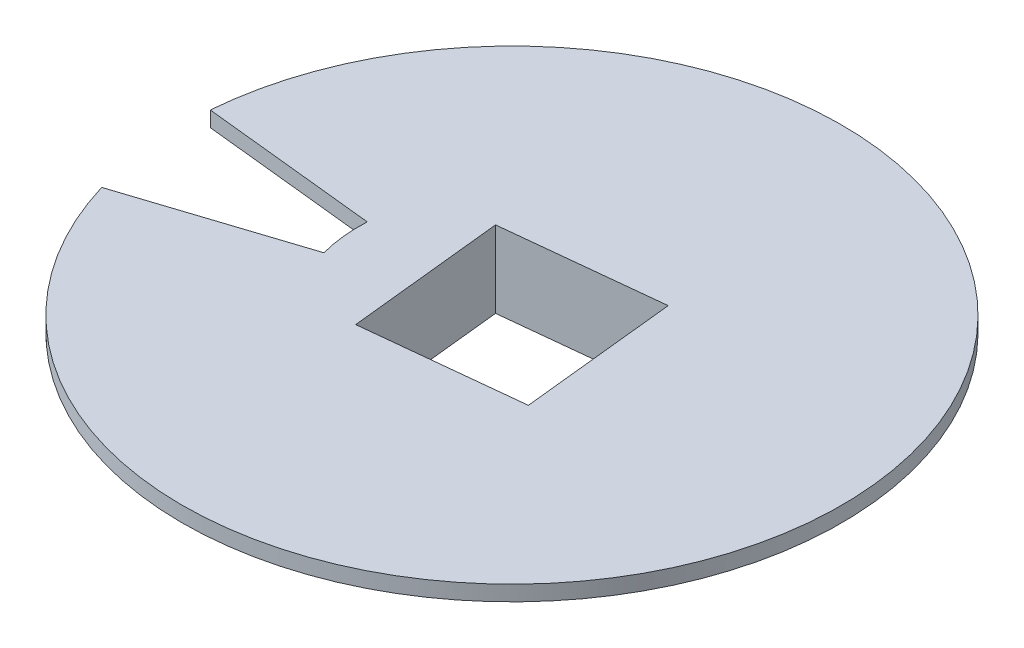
ISO-10303-21;
HEADER;
FILE_DESCRIPTION(('STEP AP214'),'2;1');
FILE_NAME('part.step','',(''),(''),'','','');
FILE_SCHEMA(('AUTOMOTIVE_DESIGN { 1 0 10303 214 1 1 1 1 }'));
ENDSEC;
DATA;
#1=APPLICATION_CONTEXT('core data for automotive mechanical design processes');
#2=APPLICATION_PROTOCOL_DEFINITION('international standard','automotive_design',2000,#1);
#3=PRODUCT_CONTEXT('',#1,'mechanical');
#4=PRODUCT('Part','Part','',(#3));
#5=PRODUCT_RELATED_PRODUCT_CATEGORY('part','',(#4));
#6=PRODUCT_DEFINITION_FORMATION('','',#4);
#7=PRODUCT_DEFINITION_CONTEXT('part definition',#1,'design');
#8=PRODUCT_DEFINITION('design','',#6,#7);
#9=PRODUCT_DEFINITION_SHAPE('','',#8);
#10=(LENGTH_UNIT() NAMED_UNIT(*) SI_UNIT(.MILLI.,.METRE.));
#11=(NAMED_UNIT(*) PLANE_ANGLE_UNIT() SI_UNIT($,.RADIAN.));
#12=(NAMED_UNIT(*) SI_UNIT($,.STERADIAN.) SOLID_ANGLE_UNIT());
#13=UNCERTAINTY_MEASURE_WITH_UNIT(LENGTH_MEASURE(1.E-05),#10,'distance_accuracy_value','');
#14=(GEOMETRIC_REPRESENTATION_CONTEXT(3) GLOBAL_UNCERTAINTY_ASSIGNED_CONTEXT((#13)) GLOBAL_UNIT_ASSIGNED_CONTEXT((#10,
#11,#12)) REPRESENTATION_CONTEXT('',''));
#15=CARTESIAN_POINT('',(0.,0.,0.));
#16=DIRECTION('',(0.,0.,1.));
#17=DIRECTION('',(1.,0.,0.));
#18=AXIS2_PLACEMENT_3D('',#15,#16,#17);
#19=CARTESIAN_POINT('',(0.,-4.,0.));
#20=DIRECTION('',(0.,-1.,0.));
#21=DIRECTION('',(1.,0.,0.));
#22=AXIS2_PLACEMENT_3D('',#19,#20,#21);
#23=PLANE('',#22);
#24=DIRECTION('',(-0.994521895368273,0.,-0.104528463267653));
#25=VECTOR('',#24,1.);
#26=CARTESIAN_POINT('',(-0.209056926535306,-4.00000000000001,1.98904379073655));
#27=LINE('',#26,#25);
#28=CARTESIAN_POINT('',(-39.9401755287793,-4.00000000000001,-2.18686504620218));
#29=VERTEX_POINT('',#28);
#30=CARTESIAN_POINT('',(-85.7148083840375,-4.00000000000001,-6.99797282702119));
#31=VERTEX_POINT('',#30);
#32=EDGE_CURVE('E141',#29,#31,#27,.T.);
#33=ORIENTED_EDGE('',*,*,#32,.T.);
#34=CARTESIAN_POINT('',(0.,-4.,0.));
#35=DIRECTION('',(0.,1.,0.));
#36=DIRECTION('',(-1.,0.,0.));
#37=AXIS2_PLACEMENT_3D('',#34,#35,#36);
#38=CIRCLE('',#37,86.);
#39=CARTESIAN_POINT('',(-82.3867738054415,-4.00000000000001,24.6661610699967));
#40=VERTEX_POINT('',#39);
#41=EDGE_CURVE('E160',#40,#31,#38,.T.);
#42=ORIENTED_EDGE('',*,*,#41,.F.);
#43=DIRECTION('',(-0.951056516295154,0.,0.309016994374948));
#44=VECTOR('',#43,1.);
#45=CARTESIAN_POINT('',(-0.618033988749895,-4.00000000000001,-1.90211303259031));
#46=LINE('',#45,#44);
#47=CARTESIAN_POINT('',(-38.6127120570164,-4.00000000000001,10.4431062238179));
#48=VERTEX_POINT('',#47);
#49=EDGE_CURVE('E144',#48,#40,#46,.T.);
#50=ORIENTED_EDGE('',*,*,#49,.F.);
#51=CARTESIAN_POINT('',(0.,-4.00000000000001,0.));
#52=DIRECTION('',(0.,1.,0.));
#53=DIRECTION('',(0.,0.,1.));
#54=AXIS2_PLACEMENT_3D('',#51,#52,#53);
#55=CIRCLE('',#54,40.);
#56=EDGE_CURVE('E155',#48,#29,#55,.T.);
#57=ORIENTED_EDGE('',*,*,#56,.T.);
#58=EDGE_LOOP('',(#33,#42,#50,#57));
#59=FACE_BOUND('',#58,.T.);
#60=ADVANCED_FACE('F34',(#59),#23,.T.);
#61=CARTESIAN_POINT('',(0.,0.,0.));
#62=DIRECTION('',(0.,1.,0.));
#63=DIRECTION('',(-1.,0.,0.));
#64=AXIS2_PLACEMENT_3D('',#61,#62,#63);
#65=CYLINDRICAL_SURFACE('',#64,86.);
#66=DIRECTION('',(0.,1.,0.));
#67=VECTOR('',#66,1.);
#68=CARTESIAN_POINT('',(-85.7148083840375,0.,-6.99797282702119));
#69=LINE('',#68,#67);
#70=CARTESIAN_POINT('',(-85.7148083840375,0.,-6.99797282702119));
#71=VERTEX_POINT('',#70);
#72=EDGE_CURVE('E153',#71,#31,#69,.F.);
#73=ORIENTED_EDGE('',*,*,#72,.F.);
#74=CARTESIAN_POINT('',(0.,0.,0.));
#75=DIRECTION('',(0.,1.,0.));
#76=DIRECTION('',(-1.,0.,0.));
#77=AXIS2_PLACEMENT_3D('',#74,#75,#76);
#78=CIRCLE('',#77,86.);
#79=CARTESIAN_POINT('',(-82.3867738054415,0.,24.6661610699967));
#80=VERTEX_POINT('',#79);
#81=EDGE_CURVE('E157',#80,#71,#78,.T.);
#82=ORIENTED_EDGE('',*,*,#81,.F.);
#83=DIRECTION('',(0.,1.,0.));
#84=VECTOR('',#83,1.);
#85=CARTESIAN_POINT('',(-82.3867738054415,0.,24.6661610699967));
#86=LINE('',#85,#84);
#87=EDGE_CURVE('E147',#80,#40,#86,.F.);
#88=ORIENTED_EDGE('',*,*,#87,.T.);
#89=ORIENTED_EDGE('',*,*,#41,.T.);
#90=EDGE_LOOP('',(#73,#82,#88,#89));
#91=FACE_BOUND('',#90,.T.);
#92=ADVANCED_FACE('F182',(#91),#65,.T.);
#93=CARTESIAN_POINT('',(0.,0.,0.));
#94=DIRECTION('',(0.,1.,0.));
#95=DIRECTION('',(-1.,0.,0.));
#96=AXIS2_PLACEMENT_3D('',#93,#94,#95);
#97=PLANE('',#96);
#98=DIRECTION('',(0.994521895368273,0.,-0.104528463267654));
#99=VECTOR('',#98,1.);
#100=CARTESIAN_POINT('',(2.14283349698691,0.,20.3876988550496));
#101=LINE('',#100,#99);
#102=CARTESIAN_POINT('',(-18.2448653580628,0.,22.5305323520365));
#103=VERTEX_POINT('',#102);
#104=CARTESIAN_POINT('',(22.5305323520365,0.,18.2448653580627));
#105=VERTEX_POINT('',#104);
#106=EDGE_CURVE('E48',#103,#105,#101,.T.);
#107=ORIENTED_EDGE('',*,*,#106,.F.);
#108=DIRECTION('',(0.104528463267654,0.,0.994521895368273));
#109=VECTOR('',#108,1.);
#110=CARTESIAN_POINT('',(-20.3876988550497,0.,2.14283349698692));
#111=LINE('',#110,#109);
#112=CARTESIAN_POINT('',(-22.5305323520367,0.,-18.2448653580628));
#113=VERTEX_POINT('',#112);
#114=EDGE_CURVE('E116',#113,#103,#111,.T.);
#115=ORIENTED_EDGE('',*,*,#114,.F.);
#116=DIRECTION('',(-0.994521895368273,0.,0.104528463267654));
#117=VECTOR('',#116,1.);
#118=CARTESIAN_POINT('',(-2.14283349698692,0.,-20.3876988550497));
#119=LINE('',#118,#117);
#120=CARTESIAN_POINT('',(18.2448653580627,0.,-22.5305323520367));
#121=VERTEX_POINT('',#120);
#122=EDGE_CURVE('E119',#121,#113,#119,.T.);
#123=ORIENTED_EDGE('',*,*,#122,.F.);
#124=DIRECTION('',(-0.104528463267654,0.,-0.994521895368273));
#125=VECTOR('',#124,1.);
#126=CARTESIAN_POINT('',(20.3876988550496,0.,-2.14283349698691));
#127=LINE('',#126,#125);
#128=EDGE_CURVE('E125',#105,#121,#127,.T.);
#129=ORIENTED_EDGE('',*,*,#128,.F.);
#130=EDGE_LOOP('',(#107,#115,#123,#129));
#131=FACE_BOUND('',#130,.T.);
#132=DIRECTION('',(-0.994521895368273,0.,-0.104528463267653));
#133=VECTOR('',#132,1.);
#134=CARTESIAN_POINT('',(-0.209056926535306,0.,1.98904379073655));
#135=LINE('',#134,#133);
#136=CARTESIAN_POINT('',(-39.9401755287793,0.,-2.18686504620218));
#137=VERTEX_POINT('',#136);
#138=EDGE_CURVE('E138',#137,#71,#135,.T.);
#139=ORIENTED_EDGE('',*,*,#138,.F.);
#140=CARTESIAN_POINT('',(0.,0.,0.));
#141=DIRECTION('',(0.,-1.,0.));
#142=DIRECTION('',(1.,0.,0.));
#143=AXIS2_PLACEMENT_3D('',#140,#141,#142);
#144=CIRCLE('',#143,40.);
#145=CARTESIAN_POINT('',(-38.6127120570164,0.,10.4431062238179));
#146=VERTEX_POINT('',#145);
#147=EDGE_CURVE('E131',#146,#137,#144,.T.);
#148=ORIENTED_EDGE('',*,*,#147,.F.);
#149=DIRECTION('',(-0.951056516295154,0.,0.309016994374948));
#150=VECTOR('',#149,1.);
#151=CARTESIAN_POINT('',(-0.618033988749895,0.,-1.90211303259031));
#152=LINE('',#151,#150);
#153=EDGE_CURVE('E145',#146,#80,#152,.T.);
#154=ORIENTED_EDGE('',*,*,#153,.T.);
#155=ORIENTED_EDGE('',*,*,#81,.T.);
#156=EDGE_LOOP('',(#139,#148,#154,#155));
#157=FACE_BOUND('',#156,.T.);
#158=ADVANCED_FACE('F179',(#131,#157),#97,.T.);
#159=CARTESIAN_POINT('',(-0.618033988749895,-4.00000000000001,-1.90211303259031));
#160=DIRECTION('',(-0.309016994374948,0.,-0.951056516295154));
#161=DIRECTION('',(-0.951056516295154,0.,0.309016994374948));
#162=AXIS2_PLACEMENT_3D('',#159,#160,#161);
#163=PLANE('',#162);
#164=ORIENTED_EDGE('',*,*,#153,.F.);
#165=DIRECTION('',(0.,1.,0.));
#166=VECTOR('',#165,1.);
#167=CARTESIAN_POINT('',(-38.6127120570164,-4.00000000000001,10.4431062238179));
#168=LINE('',#167,#166);
#169=EDGE_CURVE('E41',#146,#48,#168,.F.);
#170=ORIENTED_EDGE('',*,*,#169,.T.);
#171=ORIENTED_EDGE('',*,*,#49,.T.);
#172=ORIENTED_EDGE('',*,*,#87,.F.);
#173=EDGE_LOOP('',(#164,#170,#171,#172));
#174=FACE_BOUND('',#173,.T.);
#175=ADVANCED_FACE('F165',(#174),#163,.T.);
#176=CARTESIAN_POINT('',(-0.209056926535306,-4.00000000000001,1.98904379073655));
#177=DIRECTION('',(0.104528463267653,0.,-0.994521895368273));
#178=DIRECTION('',(-0.994521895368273,0.,-0.104528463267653));
#179=AXIS2_PLACEMENT_3D('',#176,#177,#178);
#180=PLANE('',#179);
#181=ORIENTED_EDGE('',*,*,#72,.T.);
#182=ORIENTED_EDGE('',*,*,#32,.F.);
#183=DIRECTION('',(0.,1.,0.));
#184=VECTOR('',#183,1.);
#185=CARTESIAN_POINT('',(-39.9401755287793,-4.00000000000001,-2.18686504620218));
#186=LINE('',#185,#184);
#187=EDGE_CURVE('E11',#137,#29,#186,.F.);
#188=ORIENTED_EDGE('',*,*,#187,.F.);
#189=ORIENTED_EDGE('',*,*,#138,.T.);
#190=EDGE_LOOP('',(#181,#182,#188,#189));
#191=FACE_BOUND('',#190,.T.);
#192=ADVANCED_FACE('F176',(#191),#180,.F.);
#193=CARTESIAN_POINT('',(0.,-20.,0.));
#194=DIRECTION('',(0.,1.,0.));
#195=DIRECTION('',(-1.,0.,0.));
#196=AXIS2_PLACEMENT_3D('',#193,#194,#195);
#197=CYLINDRICAL_SURFACE('',#196,40.);
#198=ORIENTED_EDGE('',*,*,#169,.F.);
#199=ORIENTED_EDGE('',*,*,#147,.T.);
#200=ORIENTED_EDGE('',*,*,#187,.T.);
#201=ORIENTED_EDGE('',*,*,#56,.F.);
#202=EDGE_LOOP('',(#198,#199,#200,#201));
#203=FACE_BOUND('',#202,.T.);
#204=CARTESIAN_POINT('',(0.,-20.,0.));
#205=DIRECTION('',(0.,-1.,0.));
#206=DIRECTION('',(1.,0.,0.));
#207=AXIS2_PLACEMENT_3D('',#204,#205,#206);
#208=CIRCLE('',#207,40.);
#209=CARTESIAN_POINT('',(40.,-20.,0.));
#210=VERTEX_POINT('',#209);
#211=EDGE_CURVE('E135',#210,#210,#208,.T.);
#212=ORIENTED_EDGE('',*,*,#211,.F.);
#213=EDGE_LOOP('',(#212));
#214=FACE_BOUND('',#213,.T.);
#215=ADVANCED_FACE('F172',(#203,#214),#197,.T.);
#216=CARTESIAN_POINT('',(0.,-20.,0.));
#217=DIRECTION('',(0.,-1.,0.));
#218=DIRECTION('',(1.,0.,0.));
#219=AXIS2_PLACEMENT_3D('',#216,#217,#218);
#220=PLANE('',#219);
#221=DIRECTION('',(0.994521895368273,0.,-0.104528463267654));
#222=VECTOR('',#221,1.);
#223=CARTESIAN_POINT('',(2.14283349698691,-20.,20.3876988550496));
#224=LINE('',#223,#222);
#225=CARTESIAN_POINT('',(-18.2448653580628,-20.,22.5305323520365));
#226=VERTEX_POINT('',#225);
#227=CARTESIAN_POINT('',(22.5305323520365,-20.,18.2448653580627));
#228=VERTEX_POINT('',#227);
#229=EDGE_CURVE('E100',#226,#228,#224,.T.);
#230=ORIENTED_EDGE('',*,*,#229,.T.);
#231=DIRECTION('',(-0.104528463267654,0.,-0.994521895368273));
#232=VECTOR('',#231,1.);
#233=CARTESIAN_POINT('',(20.3876988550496,-20.,-2.14283349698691));
#234=LINE('',#233,#232);
#235=CARTESIAN_POINT('',(18.2448653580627,-20.,-22.5305323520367));
#236=VERTEX_POINT('',#235);
#237=EDGE_CURVE('E109',#228,#236,#234,.T.);
#238=ORIENTED_EDGE('',*,*,#237,.T.);
#239=DIRECTION('',(-0.994521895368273,0.,0.104528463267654));
#240=VECTOR('',#239,1.);
#241=CARTESIAN_POINT('',(-2.14283349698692,-20.,-20.3876988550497));
#242=LINE('',#241,#240);
#243=CARTESIAN_POINT('',(-22.5305323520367,-20.,-18.2448653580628));
#244=VERTEX_POINT('',#243);
#245=EDGE_CURVE('E56',#236,#244,#242,.T.);
#246=ORIENTED_EDGE('',*,*,#245,.T.);
#247=DIRECTION('',(0.104528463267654,0.,0.994521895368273));
#248=VECTOR('',#247,1.);
#249=CARTESIAN_POINT('',(-20.3876988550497,-20.,2.14283349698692));
#250=LINE('',#249,#248);
#251=EDGE_CURVE('E106',#244,#226,#250,.T.);
#252=ORIENTED_EDGE('',*,*,#251,.T.);
#253=EDGE_LOOP('',(#230,#238,#246,#252));
#254=FACE_BOUND('',#253,.T.);
#255=ORIENTED_EDGE('',*,*,#211,.T.);
#256=EDGE_LOOP('',(#255));
#257=FACE_BOUND('',#256,.T.);
#258=ADVANCED_FACE('F113',(#254,#257),#220,.T.);
#259=CARTESIAN_POINT('',(2.14283349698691,-20.,20.3876988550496));
#260=DIRECTION('',(0.104528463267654,0.,0.994521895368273));
#261=DIRECTION('',(0.994521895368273,0.,-0.104528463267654));
#262=AXIS2_PLACEMENT_3D('',#259,#260,#261);
#263=PLANE('',#262);
#264=ORIENTED_EDGE('',*,*,#106,.T.);
#265=DIRECTION('',(0.,1.,0.));
#266=VECTOR('',#265,1.);
#267=CARTESIAN_POINT('',(22.5305323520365,-20.,18.2448653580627));
#268=LINE('',#267,#266);
#269=EDGE_CURVE('E96',#228,#105,#268,.T.);
#270=ORIENTED_EDGE('',*,*,#269,.F.);
#271=ORIENTED_EDGE('',*,*,#229,.F.);
#272=DIRECTION('',(0.,1.,0.));
#273=VECTOR('',#272,1.);
#274=CARTESIAN_POINT('',(-18.2448653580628,-20.,22.5305323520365));
#275=LINE('',#274,#273);
#276=EDGE_CURVE('E129',#226,#103,#275,.T.);
#277=ORIENTED_EDGE('',*,*,#276,.T.);
#278=EDGE_LOOP('',(#264,#270,#271,#277));
#279=FACE_BOUND('',#278,.T.);
#280=ADVANCED_FACE('F98',(#279),#263,.F.);
#281=CARTESIAN_POINT('',(-20.3876988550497,-20.,2.14283349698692));
#282=DIRECTION('',(-0.994521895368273,0.,0.104528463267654));
#283=DIRECTION('',(0.104528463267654,0.,0.994521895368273));
#284=AXIS2_PLACEMENT_3D('',#281,#282,#283);
#285=PLANE('',#284);
#286=ORIENTED_EDGE('',*,*,#114,.T.);
#287=ORIENTED_EDGE('',*,*,#276,.F.);
#288=ORIENTED_EDGE('',*,*,#251,.F.);
#289=DIRECTION('',(0.,1.,0.));
#290=VECTOR('',#289,1.);
#291=CARTESIAN_POINT('',(-22.5305323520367,-20.,-18.2448653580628));
#292=LINE('',#291,#290);
#293=EDGE_CURVE('E132',#244,#113,#292,.T.);
#294=ORIENTED_EDGE('',*,*,#293,.T.);
#295=EDGE_LOOP('',(#286,#287,#288,#294));
#296=FACE_BOUND('',#295,.T.);
#297=ADVANCED_FACE('F201',(#296),#285,.F.);
#298=CARTESIAN_POINT('',(-2.14283349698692,-20.,-20.3876988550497));
#299=DIRECTION('',(-0.104528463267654,0.,-0.994521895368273));
#300=DIRECTION('',(-0.994521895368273,0.,0.104528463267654));
#301=AXIS2_PLACEMENT_3D('',#298,#299,#300);
#302=PLANE('',#301);
#303=ORIENTED_EDGE('',*,*,#122,.T.);
#304=ORIENTED_EDGE('',*,*,#293,.F.);
#305=ORIENTED_EDGE('',*,*,#245,.F.);
#306=DIRECTION('',(0.,1.,0.));
#307=VECTOR('',#306,1.);
#308=CARTESIAN_POINT('',(18.2448653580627,-20.,-22.5305323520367));
#309=LINE('',#308,#307);
#310=EDGE_CURVE('E105',#236,#121,#309,.T.);
#311=ORIENTED_EDGE('',*,*,#310,.T.);
#312=EDGE_LOOP('',(#303,#304,#305,#311));
#313=FACE_BOUND('',#312,.T.);
#314=ADVANCED_FACE('F204',(#313),#302,.F.);
#315=CARTESIAN_POINT('',(20.3876988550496,-20.,-2.14283349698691));
#316=DIRECTION('',(0.994521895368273,0.,-0.104528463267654));
#317=DIRECTION('',(-0.104528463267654,0.,-0.994521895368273));
#318=AXIS2_PLACEMENT_3D('',#315,#316,#317);
#319=PLANE('',#318);
#320=ORIENTED_EDGE('',*,*,#128,.T.);
#321=ORIENTED_EDGE('',*,*,#310,.F.);
#322=ORIENTED_EDGE('',*,*,#237,.F.);
#323=ORIENTED_EDGE('',*,*,#269,.T.);
#324=EDGE_LOOP('',(#320,#321,#322,#323));
#325=FACE_BOUND('',#324,.T.);
#326=ADVANCED_FACE('F110',(#325),#319,.F.);
#327=CLOSED_SHELL('',(#60,#92,#158,#175,#192,#215,#258,#280,#297,#314,#326));
#328=MANIFOLD_SOLID_BREP('B2',#327);
#329=ADVANCED_BREP_SHAPE_REPRESENTATION('',(#18,#328),#14);
#330=SHAPE_DEFINITION_REPRESENTATION(#9,#329);
ENDSEC;
END-ISO-10303-21;
